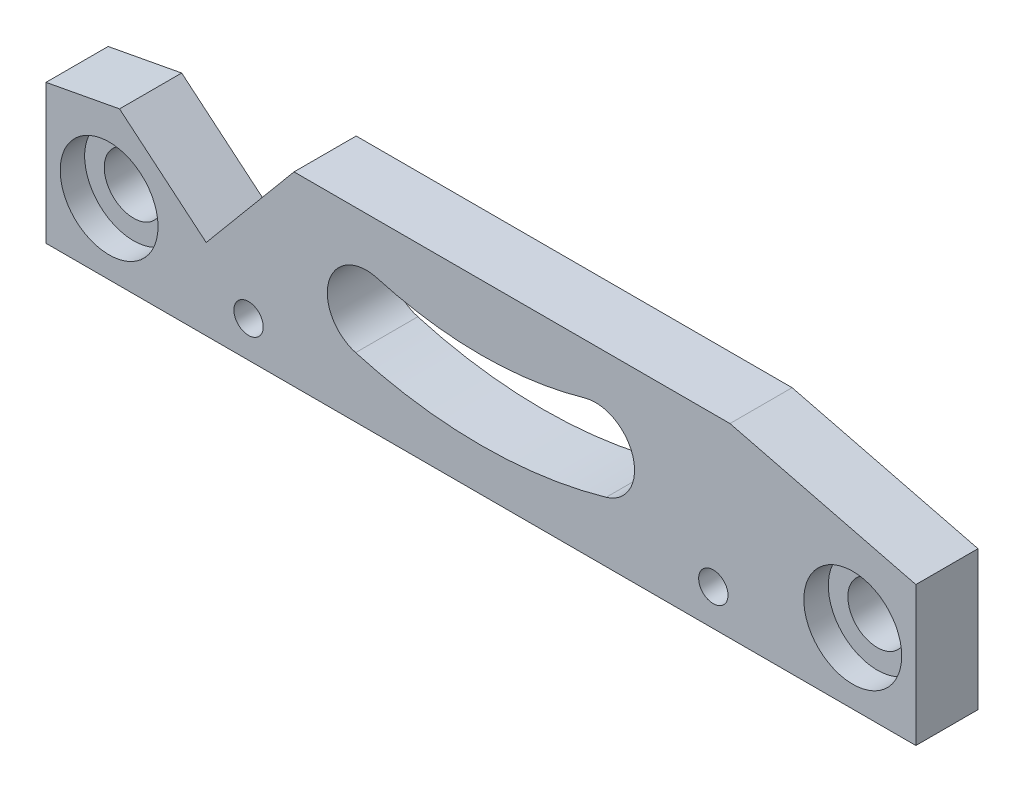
ISO-10303-21;
HEADER;
FILE_DESCRIPTION(('STEP AP214'),'2;1');
FILE_NAME('part.step','',(''),(''),'','','');
FILE_SCHEMA(('AUTOMOTIVE_DESIGN { 1 0 10303 214 1 1 1 1 }'));
ENDSEC;
DATA;
#1=APPLICATION_CONTEXT('core data for automotive mechanical design processes');
#2=APPLICATION_PROTOCOL_DEFINITION('international standard','automotive_design',2000,#1);
#3=PRODUCT_CONTEXT('',#1,'mechanical');
#4=PRODUCT('Part','Part','',(#3));
#5=PRODUCT_RELATED_PRODUCT_CATEGORY('part','',(#4));
#6=PRODUCT_DEFINITION_FORMATION('','',#4);
#7=PRODUCT_DEFINITION_CONTEXT('part definition',#1,'design');
#8=PRODUCT_DEFINITION('design','',#6,#7);
#9=PRODUCT_DEFINITION_SHAPE('','',#8);
#10=(LENGTH_UNIT() NAMED_UNIT(*) SI_UNIT(.MILLI.,.METRE.));
#11=(NAMED_UNIT(*) PLANE_ANGLE_UNIT() SI_UNIT($,.RADIAN.));
#12=(NAMED_UNIT(*) SI_UNIT($,.STERADIAN.) SOLID_ANGLE_UNIT());
#13=UNCERTAINTY_MEASURE_WITH_UNIT(LENGTH_MEASURE(1.E-05),#10,'distance_accuracy_value','');
#14=(GEOMETRIC_REPRESENTATION_CONTEXT(3) GLOBAL_UNCERTAINTY_ASSIGNED_CONTEXT((#13)) GLOBAL_UNIT_ASSIGNED_CONTEXT((#10,
#11,#12)) REPRESENTATION_CONTEXT('',''));
#15=CARTESIAN_POINT('',(0.,0.,0.));
#16=DIRECTION('',(0.,0.,1.));
#17=DIRECTION('',(1.,0.,0.));
#18=AXIS2_PLACEMENT_3D('',#15,#16,#17);
#19=CARTESIAN_POINT('',(-44.45,0.,3.17499999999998));
#20=DIRECTION('',(1.,0.,0.));
#21=DIRECTION('',(0.,0.,-1.));
#22=AXIS2_PLACEMENT_3D('',#19,#20,#21);
#23=PLANE('',#22);
#24=DIRECTION('',(0.,-1.,0.));
#25=VECTOR('',#24,1.);
#26=CARTESIAN_POINT('',(-44.45,0.,-3.17500000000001));
#27=LINE('',#26,#25);
#28=CARTESIAN_POINT('',(-44.45,14.25,-3.17500000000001));
#29=VERTEX_POINT('',#28);
#30=CARTESIAN_POINT('',(-44.45,0.,-3.17500000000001));
#31=VERTEX_POINT('',#30);
#32=EDGE_CURVE('E196',#29,#31,#27,.T.);
#33=ORIENTED_EDGE('',*,*,#32,.T.);
#34=DIRECTION('',(0.,0.,-1.));
#35=VECTOR('',#34,1.);
#36=CARTESIAN_POINT('',(-44.45,0.,3.17499999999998));
#37=LINE('',#36,#35);
#38=CARTESIAN_POINT('',(-44.45,0.,3.17499999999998));
#39=VERTEX_POINT('',#38);
#40=EDGE_CURVE('E11',#39,#31,#37,.T.);
#41=ORIENTED_EDGE('',*,*,#40,.F.);
#42=DIRECTION('',(0.,-1.,0.));
#43=VECTOR('',#42,1.);
#44=CARTESIAN_POINT('',(-44.45,0.,3.17499999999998));
#45=LINE('',#44,#43);
#46=CARTESIAN_POINT('',(-44.45,14.25,3.17499999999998));
#47=VERTEX_POINT('',#46);
#48=EDGE_CURVE('E197',#47,#39,#45,.T.);
#49=ORIENTED_EDGE('',*,*,#48,.F.);
#50=DIRECTION('',(0.,0.,-1.));
#51=VECTOR('',#50,1.);
#52=CARTESIAN_POINT('',(-44.45,14.25,3.17499999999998));
#53=LINE('',#52,#51);
#54=EDGE_CURVE('E215',#47,#29,#53,.T.);
#55=ORIENTED_EDGE('',*,*,#54,.T.);
#56=EDGE_LOOP('',(#33,#41,#49,#55));
#57=FACE_BOUND('',#56,.T.);
#58=ADVANCED_FACE('F36',(#57),#23,.F.);
#59=CARTESIAN_POINT('',(-44.45,0.,3.17499999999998));
#60=DIRECTION('',(0.,1.,0.));
#61=DIRECTION('',(0.,0.,1.));
#62=AXIS2_PLACEMENT_3D('',#59,#60,#61);
#63=PLANE('',#62);
#64=DIRECTION('',(1.,0.,0.));
#65=VECTOR('',#64,1.);
#66=CARTESIAN_POINT('',(-44.45,0.,-3.17500000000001));
#67=LINE('',#66,#65);
#68=CARTESIAN_POINT('',(44.45,0.,-3.17499999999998));
#69=VERTEX_POINT('',#68);
#70=EDGE_CURVE('E218',#31,#69,#67,.T.);
#71=ORIENTED_EDGE('',*,*,#70,.T.);
#72=DIRECTION('',(0.,0.,-1.));
#73=VECTOR('',#72,1.);
#74=CARTESIAN_POINT('',(44.45,0.,3.17500000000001));
#75=LINE('',#74,#73);
#76=CARTESIAN_POINT('',(44.45,0.,3.17500000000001));
#77=VERTEX_POINT('',#76);
#78=EDGE_CURVE('E43',#77,#69,#75,.T.);
#79=ORIENTED_EDGE('',*,*,#78,.F.);
#80=DIRECTION('',(1.,0.,0.));
#81=VECTOR('',#80,1.);
#82=CARTESIAN_POINT('',(-44.45,0.,3.17499999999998));
#83=LINE('',#82,#81);
#84=EDGE_CURVE('E200',#39,#77,#83,.T.);
#85=ORIENTED_EDGE('',*,*,#84,.F.);
#86=ORIENTED_EDGE('',*,*,#40,.T.);
#87=EDGE_LOOP('',(#71,#79,#85,#86));
#88=FACE_BOUND('',#87,.T.);
#89=ADVANCED_FACE('F274',(#88),#63,.F.);
#90=CARTESIAN_POINT('',(44.45,0.,3.17500000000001));
#91=DIRECTION('',(-1.,0.,0.));
#92=DIRECTION('',(0.,0.,1.));
#93=AXIS2_PLACEMENT_3D('',#90,#91,#92);
#94=PLANE('',#93);
#95=DIRECTION('',(0.,1.,0.));
#96=VECTOR('',#95,1.);
#97=CARTESIAN_POINT('',(44.45,0.,-3.17499999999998));
#98=LINE('',#97,#96);
#99=CARTESIAN_POINT('',(44.45,14.25,-3.17500000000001));
#100=VERTEX_POINT('',#99);
#101=EDGE_CURVE('E220',#69,#100,#98,.T.);
#102=ORIENTED_EDGE('',*,*,#101,.T.);
#103=DIRECTION('',(0.,0.,-1.));
#104=VECTOR('',#103,1.);
#105=CARTESIAN_POINT('',(44.45,14.25,3.17500000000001));
#106=LINE('',#105,#104);
#107=CARTESIAN_POINT('',(44.45,14.25,3.17500000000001));
#108=VERTEX_POINT('',#107);
#109=EDGE_CURVE('E245',#108,#100,#106,.T.);
#110=ORIENTED_EDGE('',*,*,#109,.F.);
#111=DIRECTION('',(0.,1.,0.));
#112=VECTOR('',#111,1.);
#113=CARTESIAN_POINT('',(44.45,0.,3.17500000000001));
#114=LINE('',#113,#112);
#115=EDGE_CURVE('E203',#77,#108,#114,.T.);
#116=ORIENTED_EDGE('',*,*,#115,.F.);
#117=ORIENTED_EDGE('',*,*,#78,.T.);
#118=EDGE_LOOP('',(#102,#110,#116,#117));
#119=FACE_BOUND('',#118,.T.);
#120=ADVANCED_FACE('F252',(#119),#94,.F.);
#121=CARTESIAN_POINT('',(44.45,14.25,3.17500000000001));
#122=DIRECTION('',(-0.242535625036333,-0.970142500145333,0.));
#123=DIRECTION('',(0.970142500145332,-0.242535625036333,0.));
#124=AXIS2_PLACEMENT_3D('',#121,#122,#123);
#125=PLANE('',#124);
#126=DIRECTION('',(-0.970142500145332,0.242535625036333,0.));
#127=VECTOR('',#126,1.);
#128=CARTESIAN_POINT('',(44.45,14.25,-3.17500000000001));
#129=LINE('',#128,#127);
#130=CARTESIAN_POINT('',(25.45,19.,-3.17500000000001));
#131=VERTEX_POINT('',#130);
#132=EDGE_CURVE('E222',#100,#131,#129,.T.);
#133=ORIENTED_EDGE('',*,*,#132,.T.);
#134=DIRECTION('',(0.,0.,-1.));
#135=VECTOR('',#134,1.);
#136=CARTESIAN_POINT('',(25.45,19.,3.17499999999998));
#137=LINE('',#136,#135);
#138=CARTESIAN_POINT('',(25.45,19.,3.17499999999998));
#139=VERTEX_POINT('',#138);
#140=EDGE_CURVE('E242',#139,#131,#137,.T.);
#141=ORIENTED_EDGE('',*,*,#140,.F.);
#142=DIRECTION('',(-0.970142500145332,0.242535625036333,0.));
#143=VECTOR('',#142,1.);
#144=CARTESIAN_POINT('',(44.45,14.25,3.17500000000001));
#145=LINE('',#144,#143);
#146=EDGE_CURVE('E205',#108,#139,#145,.T.);
#147=ORIENTED_EDGE('',*,*,#146,.F.);
#148=ORIENTED_EDGE('',*,*,#109,.T.);
#149=EDGE_LOOP('',(#133,#141,#147,#148));
#150=FACE_BOUND('',#149,.T.);
#151=ADVANCED_FACE('F262',(#150),#125,.F.);
#152=CARTESIAN_POINT('',(25.45,19.,3.17499999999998));
#153=DIRECTION('',(0.,-1.,0.));
#154=DIRECTION('',(0.,0.,-1.));
#155=AXIS2_PLACEMENT_3D('',#152,#153,#154);
#156=PLANE('',#155);
#157=DIRECTION('',(-1.,0.,0.));
#158=VECTOR('',#157,1.);
#159=CARTESIAN_POINT('',(25.45,19.,-3.17500000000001));
#160=LINE('',#159,#158);
#161=CARTESIAN_POINT('',(-19.1,19.,-3.17500000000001));
#162=VERTEX_POINT('',#161);
#163=EDGE_CURVE('E224',#131,#162,#160,.T.);
#164=ORIENTED_EDGE('',*,*,#163,.T.);
#165=DIRECTION('',(0.,0.,-1.));
#166=VECTOR('',#165,1.);
#167=CARTESIAN_POINT('',(-19.1,19.,3.17499999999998));
#168=LINE('',#167,#166);
#169=CARTESIAN_POINT('',(-19.1,19.,3.17499999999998));
#170=VERTEX_POINT('',#169);
#171=EDGE_CURVE('E239',#170,#162,#168,.T.);
#172=ORIENTED_EDGE('',*,*,#171,.F.);
#173=DIRECTION('',(-1.,0.,0.));
#174=VECTOR('',#173,1.);
#175=CARTESIAN_POINT('',(25.45,19.,3.17499999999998));
#176=LINE('',#175,#174);
#177=EDGE_CURVE('E207',#139,#170,#176,.T.);
#178=ORIENTED_EDGE('',*,*,#177,.F.);
#179=ORIENTED_EDGE('',*,*,#140,.T.);
#180=EDGE_LOOP('',(#164,#172,#178,#179));
#181=FACE_BOUND('',#180,.T.);
#182=ADVANCED_FACE('F266',(#181),#156,.F.);
#183=CARTESIAN_POINT('',(-28.0778892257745,8.25767692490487,3.17499999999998));
#184=DIRECTION('',(0.767308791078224,-0.641277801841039,0.));
#185=DIRECTION('',(0.641277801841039,0.767308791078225,0.));
#186=AXIS2_PLACEMENT_3D('',#183,#184,#185);
#187=PLANE('',#186);
#188=DIRECTION('',(-0.641277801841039,-0.767308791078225,0.));
#189=VECTOR('',#188,1.);
#190=CARTESIAN_POINT('',(-28.0778892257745,8.25767692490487,-3.17500000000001));
#191=LINE('',#190,#189);
#192=CARTESIAN_POINT('',(-28.0778892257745,8.25767692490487,-3.17500000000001));
#193=VERTEX_POINT('',#192);
#194=EDGE_CURVE('E226',#162,#193,#191,.T.);
#195=ORIENTED_EDGE('',*,*,#194,.T.);
#196=DIRECTION('',(0.,0.,-1.));
#197=VECTOR('',#196,1.);
#198=CARTESIAN_POINT('',(-28.0778892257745,8.25767692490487,3.17499999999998));
#199=LINE('',#198,#197);
#200=CARTESIAN_POINT('',(-28.0778892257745,8.25767692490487,3.17499999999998));
#201=VERTEX_POINT('',#200);
#202=EDGE_CURVE('E236',#201,#193,#199,.T.);
#203=ORIENTED_EDGE('',*,*,#202,.F.);
#204=DIRECTION('',(-0.641277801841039,-0.767308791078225,0.));
#205=VECTOR('',#204,1.);
#206=CARTESIAN_POINT('',(-28.0778892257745,8.25767692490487,3.17499999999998));
#207=LINE('',#206,#205);
#208=EDGE_CURVE('E209',#170,#201,#207,.T.);
#209=ORIENTED_EDGE('',*,*,#208,.F.);
#210=ORIENTED_EDGE('',*,*,#171,.T.);
#211=EDGE_LOOP('',(#195,#203,#209,#210));
#212=FACE_BOUND('',#211,.T.);
#213=ADVANCED_FACE('F287',(#212),#187,.F.);
#214=CARTESIAN_POINT('',(-36.9331770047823,15.6584776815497,3.17499999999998));
#215=DIRECTION('',(-0.641277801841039,-0.767308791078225,0.));
#216=DIRECTION('',(0.767308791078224,-0.64127780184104,0.));
#217=AXIS2_PLACEMENT_3D('',#214,#215,#216);
#218=PLANE('',#217);
#219=DIRECTION('',(-0.767308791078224,0.64127780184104,0.));
#220=VECTOR('',#219,1.);
#221=CARTESIAN_POINT('',(-36.9331770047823,15.6584776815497,-3.17500000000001));
#222=LINE('',#221,#220);
#223=CARTESIAN_POINT('',(-36.9331770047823,15.6584776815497,-3.17500000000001));
#224=VERTEX_POINT('',#223);
#225=EDGE_CURVE('E228',#193,#224,#222,.T.);
#226=ORIENTED_EDGE('',*,*,#225,.T.);
#227=DIRECTION('',(0.,0.,-1.));
#228=VECTOR('',#227,1.);
#229=CARTESIAN_POINT('',(-36.9331770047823,15.6584776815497,3.17499999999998));
#230=LINE('',#229,#228);
#231=CARTESIAN_POINT('',(-36.9331770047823,15.6584776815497,3.17499999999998));
#232=VERTEX_POINT('',#231);
#233=EDGE_CURVE('E233',#232,#224,#230,.T.);
#234=ORIENTED_EDGE('',*,*,#233,.F.);
#235=DIRECTION('',(-0.767308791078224,0.64127780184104,0.));
#236=VECTOR('',#235,1.);
#237=CARTESIAN_POINT('',(-36.9331770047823,15.6584776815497,3.17499999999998));
#238=LINE('',#237,#236);
#239=EDGE_CURVE('E211',#201,#232,#238,.T.);
#240=ORIENTED_EDGE('',*,*,#239,.F.);
#241=ORIENTED_EDGE('',*,*,#202,.T.);
#242=EDGE_LOOP('',(#226,#234,#240,#241));
#243=FACE_BOUND('',#242,.T.);
#244=ADVANCED_FACE('F285',(#243),#218,.F.);
#245=CARTESIAN_POINT('',(-44.45,14.25,3.17499999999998));
#246=DIRECTION('',(0.184171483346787,-0.982894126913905,0.));
#247=DIRECTION('',(0.982894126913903,0.184171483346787,0.));
#248=AXIS2_PLACEMENT_3D('',#245,#246,#247);
#249=PLANE('',#248);
#250=DIRECTION('',(-0.982894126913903,-0.184171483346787,0.));
#251=VECTOR('',#250,1.);
#252=CARTESIAN_POINT('',(-44.45,14.25,-3.17500000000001));
#253=LINE('',#252,#251);
#254=EDGE_CURVE('E201',#224,#29,#253,.T.);
#255=ORIENTED_EDGE('',*,*,#254,.T.);
#256=ORIENTED_EDGE('',*,*,#54,.F.);
#257=DIRECTION('',(-0.982894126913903,-0.184171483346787,0.));
#258=VECTOR('',#257,1.);
#259=CARTESIAN_POINT('',(-44.45,14.25,3.17499999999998));
#260=LINE('',#259,#258);
#261=EDGE_CURVE('E213',#232,#47,#260,.T.);
#262=ORIENTED_EDGE('',*,*,#261,.F.);
#263=ORIENTED_EDGE('',*,*,#233,.T.);
#264=EDGE_LOOP('',(#255,#256,#262,#263));
#265=FACE_BOUND('',#264,.T.);
#266=ADVANCED_FACE('F280',(#265),#249,.F.);
#267=CARTESIAN_POINT('',(0.,0.,3.17499999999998));
#268=DIRECTION('',(0.,0.,1.));
#269=DIRECTION('',(1.,0.,0.));
#270=AXIS2_PLACEMENT_3D('',#267,#268,#269);
#271=PLANE('',#270);
#272=CARTESIAN_POINT('',(-11.7008057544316,9.99444100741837,3.17499999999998));
#273=DIRECTION('',(0.,0.,1.));
#274=DIRECTION('',(1.,0.,0.));
#275=AXIS2_PLACEMENT_3D('',#272,#273,#274);
#276=CIRCLE('',#275,4.);
#277=CARTESIAN_POINT('',(-10.5982563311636,13.8394877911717,3.17499999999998));
#278=VERTEX_POINT('',#277);
#279=CARTESIAN_POINT('',(-12.8033551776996,6.1493942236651,3.17499999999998));
#280=VERTEX_POINT('',#279);
#281=EDGE_CURVE('E50',#278,#280,#276,.T.);
#282=ORIENTED_EDGE('',*,*,#281,.F.);
#283=CARTESIAN_POINT('',(0.,50.8000000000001,3.17499999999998));
#284=DIRECTION('',(0.,0.,-1.));
#285=DIRECTION('',(1.,0.,0.));
#286=AXIS2_PLACEMENT_3D('',#283,#284,#285);
#287=CIRCLE('',#286,38.45);
#288=CARTESIAN_POINT('',(10.5982563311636,13.8394877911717,3.17499999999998));
#289=VERTEX_POINT('',#288);
#290=EDGE_CURVE('E132',#289,#278,#287,.T.);
#291=ORIENTED_EDGE('',*,*,#290,.F.);
#292=CARTESIAN_POINT('',(11.7008057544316,9.99444100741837,3.17499999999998));
#293=DIRECTION('',(0.,0.,1.));
#294=DIRECTION('',(1.,0.,0.));
#295=AXIS2_PLACEMENT_3D('',#292,#293,#294);
#296=CIRCLE('',#295,4.);
#297=CARTESIAN_POINT('',(12.8033551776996,6.14939422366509,3.17499999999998));
#298=VERTEX_POINT('',#297);
#299=EDGE_CURVE('E152',#298,#289,#296,.T.);
#300=ORIENTED_EDGE('',*,*,#299,.F.);
#301=CARTESIAN_POINT('',(0.,50.8000000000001,3.17499999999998));
#302=DIRECTION('',(0.,0.,1.));
#303=DIRECTION('',(1.,0.,0.));
#304=AXIS2_PLACEMENT_3D('',#301,#302,#303);
#305=CIRCLE('',#304,46.45);
#306=EDGE_CURVE('E146',#280,#298,#305,.T.);
#307=ORIENTED_EDGE('',*,*,#306,.F.);
#308=EDGE_LOOP('',(#282,#291,#300,#307));
#309=FACE_BOUND('',#308,.T.);
#310=CARTESIAN_POINT('',(23.75,3.70000000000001,3.17500000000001));
#311=DIRECTION('',(0.,0.,1.));
#312=DIRECTION('',(1.,0.,0.));
#313=AXIS2_PLACEMENT_3D('',#310,#311,#312);
#314=CIRCLE('',#313,1.49999999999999);
#315=CARTESIAN_POINT('',(25.25,3.70000000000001,3.17500000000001));
#316=VERTEX_POINT('',#315);
#317=EDGE_CURVE('E138',#316,#316,#314,.T.);
#318=ORIENTED_EDGE('',*,*,#317,.F.);
#319=EDGE_LOOP('',(#318));
#320=FACE_BOUND('',#319,.T.);
#321=CARTESIAN_POINT('',(-23.75,3.70000000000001,3.17499999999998));
#322=DIRECTION('',(0.,0.,1.));
#323=DIRECTION('',(1.,0.,0.));
#324=AXIS2_PLACEMENT_3D('',#321,#322,#323);
#325=CIRCLE('',#324,1.49999999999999);
#326=CARTESIAN_POINT('',(-22.25,3.70000000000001,3.17499999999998));
#327=VERTEX_POINT('',#326);
#328=EDGE_CURVE('E166',#327,#327,#325,.T.);
#329=ORIENTED_EDGE('',*,*,#328,.F.);
#330=EDGE_LOOP('',(#329));
#331=FACE_BOUND('',#330,.T.);
#332=CARTESIAN_POINT('',(38.,7.20000000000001,3.17500000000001));
#333=DIRECTION('',(0.,0.,1.));
#334=DIRECTION('',(1.,0.,0.));
#335=AXIS2_PLACEMENT_3D('',#332,#333,#334);
#336=CIRCLE('',#335,5.);
#337=CARTESIAN_POINT('',(43.,7.20000000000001,3.17500000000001));
#338=VERTEX_POINT('',#337);
#339=EDGE_CURVE('E172',#338,#338,#336,.T.);
#340=ORIENTED_EDGE('',*,*,#339,.F.);
#341=EDGE_LOOP('',(#340));
#342=FACE_BOUND('',#341,.T.);
#343=CARTESIAN_POINT('',(-38.,7.2,3.17499999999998));
#344=DIRECTION('',(0.,0.,1.));
#345=DIRECTION('',(1.,0.,0.));
#346=AXIS2_PLACEMENT_3D('',#343,#344,#345);
#347=CIRCLE('',#346,5.);
#348=CARTESIAN_POINT('',(-33.,7.2,3.17499999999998));
#349=VERTEX_POINT('',#348);
#350=EDGE_CURVE('E184',#349,#349,#347,.T.);
#351=ORIENTED_EDGE('',*,*,#350,.F.);
#352=EDGE_LOOP('',(#351));
#353=FACE_BOUND('',#352,.T.);
#354=ORIENTED_EDGE('',*,*,#48,.T.);
#355=ORIENTED_EDGE('',*,*,#84,.T.);
#356=ORIENTED_EDGE('',*,*,#115,.T.);
#357=ORIENTED_EDGE('',*,*,#146,.T.);
#358=ORIENTED_EDGE('',*,*,#177,.T.);
#359=ORIENTED_EDGE('',*,*,#208,.T.);
#360=ORIENTED_EDGE('',*,*,#239,.T.);
#361=ORIENTED_EDGE('',*,*,#261,.T.);
#362=EDGE_LOOP('',(#354,#355,#356,#357,#358,#359,#360,#361));
#363=FACE_BOUND('',#362,.T.);
#364=ADVANCED_FACE('F270',(#309,#320,#331,#342,#353,#363),#271,.T.);
#365=CARTESIAN_POINT('',(0.,0.,-3.17499999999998));
#366=DIRECTION('',(0.,0.,1.));
#367=DIRECTION('',(1.,0.,0.));
#368=AXIS2_PLACEMENT_3D('',#365,#366,#367);
#369=PLANE('',#368);
#370=CARTESIAN_POINT('',(0.,50.8000000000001,-3.17500000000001));
#371=DIRECTION('',(0.,0.,1.));
#372=DIRECTION('',(1.,0.,0.));
#373=AXIS2_PLACEMENT_3D('',#370,#371,#372);
#374=CIRCLE('',#373,38.45);
#375=CARTESIAN_POINT('',(-10.5982563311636,13.8394877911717,-3.17500000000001));
#376=VERTEX_POINT('',#375);
#377=CARTESIAN_POINT('',(10.5982563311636,13.8394877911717,-3.17500000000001));
#378=VERTEX_POINT('',#377);
#379=EDGE_CURVE('E144',#376,#378,#374,.T.);
#380=ORIENTED_EDGE('',*,*,#379,.F.);
#381=CARTESIAN_POINT('',(-11.7008057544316,9.99444100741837,-3.17500000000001));
#382=DIRECTION('',(0.,0.,1.));
#383=DIRECTION('',(1.,0.,0.));
#384=AXIS2_PLACEMENT_3D('',#381,#382,#383);
#385=CIRCLE('',#384,4.);
#386=CARTESIAN_POINT('',(-12.8033551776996,6.1493942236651,-3.17500000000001));
#387=VERTEX_POINT('',#386);
#388=EDGE_CURVE('E126',#387,#376,#385,.F.);
#389=ORIENTED_EDGE('',*,*,#388,.F.);
#390=CARTESIAN_POINT('',(0.,50.8000000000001,-3.17500000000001));
#391=DIRECTION('',(0.,0.,1.));
#392=DIRECTION('',(1.,0.,0.));
#393=AXIS2_PLACEMENT_3D('',#390,#391,#392);
#394=CIRCLE('',#393,46.45);
#395=CARTESIAN_POINT('',(12.8033551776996,6.14939422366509,-3.17500000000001));
#396=VERTEX_POINT('',#395);
#397=EDGE_CURVE('E135',#396,#387,#394,.F.);
#398=ORIENTED_EDGE('',*,*,#397,.F.);
#399=CARTESIAN_POINT('',(11.7008057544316,9.99444100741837,-3.17500000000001));
#400=DIRECTION('',(0.,0.,1.));
#401=DIRECTION('',(1.,0.,0.));
#402=AXIS2_PLACEMENT_3D('',#399,#400,#401);
#403=CIRCLE('',#402,4.);
#404=EDGE_CURVE('E58',#378,#396,#403,.F.);
#405=ORIENTED_EDGE('',*,*,#404,.F.);
#406=EDGE_LOOP('',(#380,#389,#398,#405));
#407=FACE_BOUND('',#406,.T.);
#408=CARTESIAN_POINT('',(23.75,3.70000000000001,-3.17499999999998));
#409=DIRECTION('',(0.,0.,1.));
#410=DIRECTION('',(1.,0.,0.));
#411=AXIS2_PLACEMENT_3D('',#408,#409,#410);
#412=CIRCLE('',#411,1.5);
#413=CARTESIAN_POINT('',(25.25,3.70000000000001,-3.17499999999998));
#414=VERTEX_POINT('',#413);
#415=EDGE_CURVE('E163',#414,#414,#412,.T.);
#416=ORIENTED_EDGE('',*,*,#415,.T.);
#417=EDGE_LOOP('',(#416));
#418=FACE_BOUND('',#417,.T.);
#419=CARTESIAN_POINT('',(-23.75,3.70000000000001,-3.17500000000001));
#420=DIRECTION('',(0.,0.,1.));
#421=DIRECTION('',(1.,0.,0.));
#422=AXIS2_PLACEMENT_3D('',#419,#420,#421);
#423=CIRCLE('',#422,1.5);
#424=CARTESIAN_POINT('',(-22.25,3.70000000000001,-3.17500000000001));
#425=VERTEX_POINT('',#424);
#426=EDGE_CURVE('E169',#425,#425,#423,.T.);
#427=ORIENTED_EDGE('',*,*,#426,.T.);
#428=EDGE_LOOP('',(#427));
#429=FACE_BOUND('',#428,.T.);
#430=CARTESIAN_POINT('',(38.,7.20000000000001,-3.17500000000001));
#431=DIRECTION('',(0.,0.,1.));
#432=DIRECTION('',(1.,0.,0.));
#433=AXIS2_PLACEMENT_3D('',#430,#431,#432);
#434=CIRCLE('',#433,3.);
#435=CARTESIAN_POINT('',(41.,7.20000000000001,-3.17500000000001));
#436=VERTEX_POINT('',#435);
#437=EDGE_CURVE('E181',#436,#436,#434,.T.);
#438=ORIENTED_EDGE('',*,*,#437,.T.);
#439=EDGE_LOOP('',(#438));
#440=FACE_BOUND('',#439,.T.);
#441=CARTESIAN_POINT('',(-38.,7.2,-3.17500000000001));
#442=DIRECTION('',(0.,0.,1.));
#443=DIRECTION('',(1.,0.,0.));
#444=AXIS2_PLACEMENT_3D('',#441,#442,#443);
#445=CIRCLE('',#444,3.);
#446=CARTESIAN_POINT('',(-35.,7.2,-3.17500000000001));
#447=VERTEX_POINT('',#446);
#448=EDGE_CURVE('E193',#447,#447,#445,.T.);
#449=ORIENTED_EDGE('',*,*,#448,.T.);
#450=EDGE_LOOP('',(#449));
#451=FACE_BOUND('',#450,.T.);
#452=ORIENTED_EDGE('',*,*,#32,.F.);
#453=ORIENTED_EDGE('',*,*,#254,.F.);
#454=ORIENTED_EDGE('',*,*,#225,.F.);
#455=ORIENTED_EDGE('',*,*,#194,.F.);
#456=ORIENTED_EDGE('',*,*,#163,.F.);
#457=ORIENTED_EDGE('',*,*,#132,.F.);
#458=ORIENTED_EDGE('',*,*,#101,.F.);
#459=ORIENTED_EDGE('',*,*,#70,.F.);
#460=EDGE_LOOP('',(#452,#453,#454,#455,#456,#457,#458,#459));
#461=FACE_BOUND('',#460,.T.);
#462=ADVANCED_FACE('F141',(#407,#418,#429,#440,#451,#461),#369,.F.);
#463=CARTESIAN_POINT('',(-38.,7.2,3.17499999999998));
#464=DIRECTION('',(0.,0.,1.));
#465=DIRECTION('',(1.,0.,0.));
#466=AXIS2_PLACEMENT_3D('',#463,#464,#465);
#467=CYLINDRICAL_SURFACE('',#466,3.);
#468=ORIENTED_EDGE('',*,*,#448,.F.);
#469=EDGE_LOOP('',(#468));
#470=FACE_BOUND('',#469,.T.);
#471=CARTESIAN_POINT('',(-38.,7.2,0.674999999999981));
#472=DIRECTION('',(0.,0.,1.));
#473=DIRECTION('',(1.,0.,0.));
#474=AXIS2_PLACEMENT_3D('',#471,#472,#473);
#475=CIRCLE('',#474,3.);
#476=CARTESIAN_POINT('',(-35.,7.2,0.674999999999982));
#477=VERTEX_POINT('',#476);
#478=EDGE_CURVE('E190',#477,#477,#475,.T.);
#479=ORIENTED_EDGE('',*,*,#478,.T.);
#480=EDGE_LOOP('',(#479));
#481=FACE_BOUND('',#480,.T.);
#482=ADVANCED_FACE('F340',(#470,#481),#467,.F.);
#483=CARTESIAN_POINT('',(-35.,7.2,0.674999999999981));
#484=DIRECTION('',(0.,0.,-1.));
#485=DIRECTION('',(-1.,0.,0.));
#486=AXIS2_PLACEMENT_3D('',#483,#484,#485);
#487=PLANE('',#486);
#488=ORIENTED_EDGE('',*,*,#478,.F.);
#489=EDGE_LOOP('',(#488));
#490=FACE_BOUND('',#489,.T.);
#491=CARTESIAN_POINT('',(-38.,7.2,0.674999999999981));
#492=DIRECTION('',(0.,0.,1.));
#493=DIRECTION('',(1.,0.,0.));
#494=AXIS2_PLACEMENT_3D('',#491,#492,#493);
#495=CIRCLE('',#494,5.);
#496=CARTESIAN_POINT('',(-33.,7.2,0.674999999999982));
#497=VERTEX_POINT('',#496);
#498=EDGE_CURVE('E187',#497,#497,#495,.T.);
#499=ORIENTED_EDGE('',*,*,#498,.T.);
#500=EDGE_LOOP('',(#499));
#501=FACE_BOUND('',#500,.T.);
#502=ADVANCED_FACE('F347',(#490,#501),#487,.F.);
#503=CARTESIAN_POINT('',(-38.,7.2,3.17499999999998));
#504=DIRECTION('',(0.,0.,1.));
#505=DIRECTION('',(1.,0.,0.));
#506=AXIS2_PLACEMENT_3D('',#503,#504,#505);
#507=CYLINDRICAL_SURFACE('',#506,5.);
#508=ORIENTED_EDGE('',*,*,#498,.F.);
#509=EDGE_LOOP('',(#508));
#510=FACE_BOUND('',#509,.T.);
#511=ORIENTED_EDGE('',*,*,#350,.T.);
#512=EDGE_LOOP('',(#511));
#513=FACE_BOUND('',#512,.T.);
#514=ADVANCED_FACE('F355',(#510,#513),#507,.F.);
#515=CARTESIAN_POINT('',(38.,7.20000000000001,3.17500000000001));
#516=DIRECTION('',(0.,0.,1.));
#517=DIRECTION('',(1.,0.,0.));
#518=AXIS2_PLACEMENT_3D('',#515,#516,#517);
#519=CYLINDRICAL_SURFACE('',#518,3.);
#520=ORIENTED_EDGE('',*,*,#437,.F.);
#521=EDGE_LOOP('',(#520));
#522=FACE_BOUND('',#521,.T.);
#523=CARTESIAN_POINT('',(38.,7.20000000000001,0.675000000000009));
#524=DIRECTION('',(0.,0.,1.));
#525=DIRECTION('',(1.,0.,0.));
#526=AXIS2_PLACEMENT_3D('',#523,#524,#525);
#527=CIRCLE('',#526,3.);
#528=CARTESIAN_POINT('',(41.,7.20000000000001,0.675000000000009));
#529=VERTEX_POINT('',#528);
#530=EDGE_CURVE('E178',#529,#529,#527,.T.);
#531=ORIENTED_EDGE('',*,*,#530,.T.);
#532=EDGE_LOOP('',(#531));
#533=FACE_BOUND('',#532,.T.);
#534=ADVANCED_FACE('F363',(#522,#533),#519,.F.);
#535=CARTESIAN_POINT('',(41.,7.20000000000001,0.675000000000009));
#536=DIRECTION('',(0.,0.,-1.));
#537=DIRECTION('',(-1.,0.,0.));
#538=AXIS2_PLACEMENT_3D('',#535,#536,#537);
#539=PLANE('',#538);
#540=ORIENTED_EDGE('',*,*,#530,.F.);
#541=EDGE_LOOP('',(#540));
#542=FACE_BOUND('',#541,.T.);
#543=CARTESIAN_POINT('',(38.,7.20000000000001,0.675000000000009));
#544=DIRECTION('',(0.,0.,1.));
#545=DIRECTION('',(1.,0.,0.));
#546=AXIS2_PLACEMENT_3D('',#543,#544,#545);
#547=CIRCLE('',#546,5.);
#548=CARTESIAN_POINT('',(43.,7.20000000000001,0.675000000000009));
#549=VERTEX_POINT('',#548);
#550=EDGE_CURVE('E175',#549,#549,#547,.T.);
#551=ORIENTED_EDGE('',*,*,#550,.T.);
#552=EDGE_LOOP('',(#551));
#553=FACE_BOUND('',#552,.T.);
#554=ADVANCED_FACE('F371',(#542,#553),#539,.F.);
#555=CARTESIAN_POINT('',(38.,7.20000000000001,3.17500000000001));
#556=DIRECTION('',(0.,0.,1.));
#557=DIRECTION('',(1.,0.,0.));
#558=AXIS2_PLACEMENT_3D('',#555,#556,#557);
#559=CYLINDRICAL_SURFACE('',#558,5.);
#560=ORIENTED_EDGE('',*,*,#550,.F.);
#561=EDGE_LOOP('',(#560));
#562=FACE_BOUND('',#561,.T.);
#563=ORIENTED_EDGE('',*,*,#339,.T.);
#564=EDGE_LOOP('',(#563));
#565=FACE_BOUND('',#564,.T.);
#566=ADVANCED_FACE('F379',(#562,#565),#559,.F.);
#567=CARTESIAN_POINT('',(-23.75,3.70000000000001,3.17499999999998));
#568=DIRECTION('',(0.,0.,1.));
#569=DIRECTION('',(1.,0.,0.));
#570=AXIS2_PLACEMENT_3D('',#567,#568,#569);
#571=CYLINDRICAL_SURFACE('',#570,1.49999999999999);
#572=ORIENTED_EDGE('',*,*,#426,.F.);
#573=EDGE_LOOP('',(#572));
#574=FACE_BOUND('',#573,.T.);
#575=ORIENTED_EDGE('',*,*,#328,.T.);
#576=EDGE_LOOP('',(#575));
#577=FACE_BOUND('',#576,.T.);
#578=ADVANCED_FACE('F387',(#574,#577),#571,.F.);
#579=CARTESIAN_POINT('',(23.75,3.70000000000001,3.17500000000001));
#580=DIRECTION('',(0.,0.,1.));
#581=DIRECTION('',(1.,0.,0.));
#582=AXIS2_PLACEMENT_3D('',#579,#580,#581);
#583=CYLINDRICAL_SURFACE('',#582,1.49999999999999);
#584=ORIENTED_EDGE('',*,*,#415,.F.);
#585=EDGE_LOOP('',(#584));
#586=FACE_BOUND('',#585,.T.);
#587=ORIENTED_EDGE('',*,*,#317,.T.);
#588=EDGE_LOOP('',(#587));
#589=FACE_BOUND('',#588,.T.);
#590=ADVANCED_FACE('F395',(#586,#589),#583,.F.);
#591=CARTESIAN_POINT('',(-11.7008057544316,9.99444100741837,-3.17600000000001));
#592=DIRECTION('',(0.,0.,1.));
#593=DIRECTION('',(1.,0.,0.));
#594=AXIS2_PLACEMENT_3D('',#591,#592,#593);
#595=CYLINDRICAL_SURFACE('',#594,4.);
#596=ORIENTED_EDGE('',*,*,#388,.T.);
#597=DIRECTION('',(0.,0.,1.));
#598=VECTOR('',#597,1.);
#599=CARTESIAN_POINT('',(-10.5982563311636,13.8394877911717,-3.17600000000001));
#600=LINE('',#599,#598);
#601=EDGE_CURVE('E139',#376,#278,#600,.T.);
#602=ORIENTED_EDGE('',*,*,#601,.T.);
#603=ORIENTED_EDGE('',*,*,#281,.T.);
#604=DIRECTION('',(0.,0.,1.));
#605=VECTOR('',#604,1.);
#606=CARTESIAN_POINT('',(-12.8033551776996,6.1493942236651,-3.17600000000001));
#607=LINE('',#606,#605);
#608=EDGE_CURVE('E122',#387,#280,#607,.T.);
#609=ORIENTED_EDGE('',*,*,#608,.F.);
#610=EDGE_LOOP('',(#596,#602,#603,#609));
#611=FACE_BOUND('',#610,.T.);
#612=ADVANCED_FACE('F124',(#611),#595,.F.);
#613=CARTESIAN_POINT('',(0.,50.8000000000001,-3.17600000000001));
#614=DIRECTION('',(0.,0.,1.));
#615=DIRECTION('',(1.,0.,0.));
#616=AXIS2_PLACEMENT_3D('',#613,#614,#615);
#617=CYLINDRICAL_SURFACE('',#616,38.45);
#618=ORIENTED_EDGE('',*,*,#379,.T.);
#619=DIRECTION('',(0.,0.,1.));
#620=VECTOR('',#619,1.);
#621=CARTESIAN_POINT('',(10.5982563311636,13.8394877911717,-3.17600000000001));
#622=LINE('',#621,#620);
#623=EDGE_CURVE('E158',#378,#289,#622,.T.);
#624=ORIENTED_EDGE('',*,*,#623,.T.);
#625=ORIENTED_EDGE('',*,*,#290,.T.);
#626=ORIENTED_EDGE('',*,*,#601,.F.);
#627=EDGE_LOOP('',(#618,#624,#625,#626));
#628=FACE_BOUND('',#627,.T.);
#629=ADVANCED_FACE('F410',(#628),#617,.T.);
#630=CARTESIAN_POINT('',(11.7008057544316,9.99444100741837,-3.17600000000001));
#631=DIRECTION('',(0.,0.,1.));
#632=DIRECTION('',(1.,0.,0.));
#633=AXIS2_PLACEMENT_3D('',#630,#631,#632);
#634=CYLINDRICAL_SURFACE('',#633,4.);
#635=ORIENTED_EDGE('',*,*,#404,.T.);
#636=DIRECTION('',(0.,0.,1.));
#637=VECTOR('',#636,1.);
#638=CARTESIAN_POINT('',(12.8033551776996,6.14939422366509,-3.17600000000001));
#639=LINE('',#638,#637);
#640=EDGE_CURVE('E131',#396,#298,#639,.T.);
#641=ORIENTED_EDGE('',*,*,#640,.T.);
#642=ORIENTED_EDGE('',*,*,#299,.T.);
#643=ORIENTED_EDGE('',*,*,#623,.F.);
#644=EDGE_LOOP('',(#635,#641,#642,#643));
#645=FACE_BOUND('',#644,.T.);
#646=ADVANCED_FACE('F417',(#645),#634,.F.);
#647=CARTESIAN_POINT('',(0.,50.8000000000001,-3.17600000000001));
#648=DIRECTION('',(0.,0.,1.));
#649=DIRECTION('',(1.,0.,0.));
#650=AXIS2_PLACEMENT_3D('',#647,#648,#649);
#651=CYLINDRICAL_SURFACE('',#650,46.45);
#652=ORIENTED_EDGE('',*,*,#397,.T.);
#653=ORIENTED_EDGE('',*,*,#608,.T.);
#654=ORIENTED_EDGE('',*,*,#306,.T.);
#655=ORIENTED_EDGE('',*,*,#640,.F.);
#656=EDGE_LOOP('',(#652,#653,#654,#655));
#657=FACE_BOUND('',#656,.T.);
#658=ADVANCED_FACE('F136',(#657),#651,.F.);
#659=CLOSED_SHELL('',(#58,#89,#120,#151,#182,#213,#244,#266,#364,#462,#482,#502,#514,#534,#554,
#566,#578,#590,#612,#629,#646,#658));
#660=MANIFOLD_SOLID_BREP('B2',#659);
#661=ADVANCED_BREP_SHAPE_REPRESENTATION('',(#18,#660),#14);
#662=SHAPE_DEFINITION_REPRESENTATION(#9,#661);
ENDSEC;
END-ISO-10303-21;
